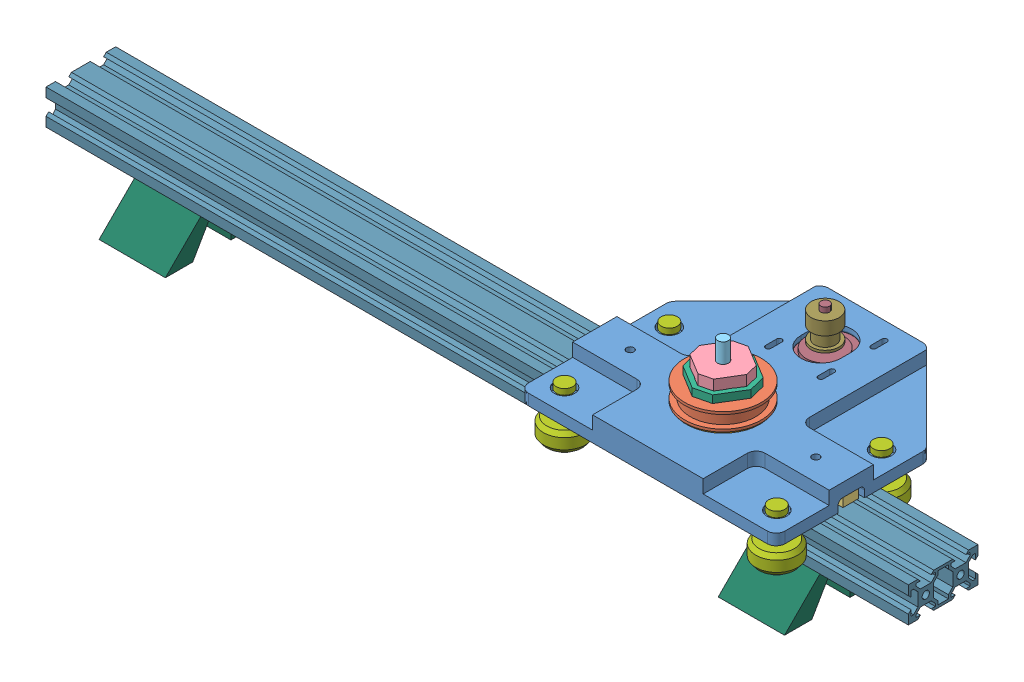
SolidWorks assembly Total Assembly.SLDASM, configuration Default (file format 15000). Lengths in mm.
Overall size (495.3 90.06 134.72).
22 component instances, 15 part files, 5 mates.
Components (placement in the parent):
- Camera Mount Assembly-1: Camera Mount Assembly.SLDASM [Default] at (442.5309 13.081 -43.18) x (-1 0 0) z (0 0 -1) size (155.86 75.87 134.72)
  - Camera Adapter w Bearings-1: Camera Adapter w Bearings.SLDPRT [Default] at origin size (147.32 13.97 130.81)
  - Big Pully-1: Big Pully.SLDPRT [Default] at (73.66 25.4 -43.18) x (-0.462019 0 -0.88687) z (-0.88687 0 0.462019) size (43.94 16.13 43.94)
  - Timing Belt Holder-1: Timing Belt Holder.SLDPRT [Default] at (20.32 6.35 -43.18) x (1 0 0) z (0 0 -1) size (40 5.33 9.04)
  - Timing Belt Holder-2: Timing Belt Holder.SLDPRT [Default] at (127 6.35 -43.18) x (1 0 0) z (0 0 -1) size (40 5.33 9.04)
  - Camera to Shaft Adapter-1: Camera to Shaft Adapter.SLDPRT [Glue] at (73.66 31.75 -43.18) x (0.520118 0 -0.854095) z (-0.854095 0 -0.520118) size (24.38 10.16 24.38)
  - Camera Screw-1: Camera Screw.SLDPRT [Default] at (73.66 29.845 -43.18) x (-0.520118 0 0.854095) z (-0.854095 0 -0.520118) size (18.03 16.81 18.03)
  - Shaft-1: Shaft.SLDPRT [Default] at (73.66 29.718 -43.18) x (-0.520118 0 0.854095) z (0.854095 0 0.520118) size (29.72 22.35 29.72)
  - Bearings-1: Bearings.SLDPRT [Default] at (134.62 9.1948 -13.1064) x (0.724268 0 0.689518) z (-0.689518 0 0.724268) size (24 32.44 24)
  - Bearings-2: Bearings.SLDPRT [Default] at (12.7 9.1948 -13.1064) x (0.724268 0 0.689518) z (-0.689518 0 0.724268) size (24 32.44 24)
  - Bearings-3: Bearings.SLDPRT [Default] at (134.62 9.1948 -73.3044) x (0.724268 0 0.689518) z (-0.689518 0 0.724268) size (24 32.44 24)
  - Bearings-4: Bearings.SLDPRT [Default] at (12.7 9.1948 -73.3044) x (0.724268 0 0.689518) z (-0.689518 0 0.724268) size (24 32.44 24)
  - Big Pully Adapter-1: Big Pully Adapter.SLDPRT [Default] at (73.66 7.366 -43.18) x (-0.046219 0 -0.998931) z (0.998931 0 -0.046219) size (33.02 7.87 33.02)
  - Shaft Bearing-1: Shaft Bearing.SLDPRT [Default] at (73.66 10.4775 -43.18) x (0.99903 0 -0.044037) z (0.044037 0 0.99903) size (42.01 6.99 42.01)
  - Encoder Chip-1: Encoder Chip.SLDPRT [Default] at (73.7235 2.667 -43.2435) x (0 0 1) z (-1 0 0) size (23.49 3.3 22.86)
  - Magnet-1: Magnet.SLDPRT [Default] at (73.66 7.366 -43.18) x (0.998847 0 -0.048009) z (0.048009 0 0.998847) size (3.99 2.01 3.99)
  - Small Pully-1: Small Pully.SLDPRT [Default] at (73.66 31.3055 15.4686) x (-1 0 0) z (0 1 0) size (16 16 16)
  - Stepper Motor-1: Stepper Motor.SLDPRT [Default] at (73.66 -29.21 15.4686) size (42.16 63.5 48.26)
- Feet Assembly-1: Feet Assembly.SLDASM [Default] at origin size (495.3 40.32 80.64)
  - 2040 Extrusion-1: 2040 Extrusion.SLDPRT [Default] at origin size (495.3 20 40)
  - Feet-1: Feet.SLDPRT [Default] at (406.4 -11.905 0) size (38.1 20.32 80.64)
  - Feet-2: Feet.SLDPRT [Default] at (50.8 -11.905 0) size (38.1 20.32 80.64)
Mates (geometry in assembly coordinates):
- Coincident1: coincident aligned: plane of Feet Assembly-1 through (0 0 0) normal (0 0 1)
- Coincident2: coincident aligned: plane of Feet Assembly-1 through (0 0 0) normal (0 1 0)
- Coincident3: coincident aligned: plane of Feet Assembly-1 through (0 0 0) normal (1 0 0)
- Width1: width anti-aligned: plane of Camera Mount Assembly-1/Timing Belt Holder-2 through (335.5334 14.097 4.5212) normal (0 0 1); plane of Feet Assembly-1/2040 Extrusion-1 through (335.5334 14.097 -4.5212) normal (0 0 -1); plane of Camera Mount Assembly-1/Timing Belt Holder-2 through (495.3 0 -20) normal (0 0 -1); plane of Feet Assembly-1/2040 Extrusion-1 through (495.3 0 20) normal (0 0 1)
- Width2: width aligned: plane of Camera Mount Assembly-1/Bearings-1 through (304.4607 5.461 -26.4495) normal (0 1 0); plane of Feet Assembly-1/2040 Extrusion-1 through (300.9054 -5.461 -22.715) normal (0 -1 0); plane of Camera Mount Assembly-1/Bearings-1 through (495.3 10 0) normal (0 1 0); plane of Feet Assembly-1/2040 Extrusion-1 through (495.3 -10 0) normal (0 -1 0)
